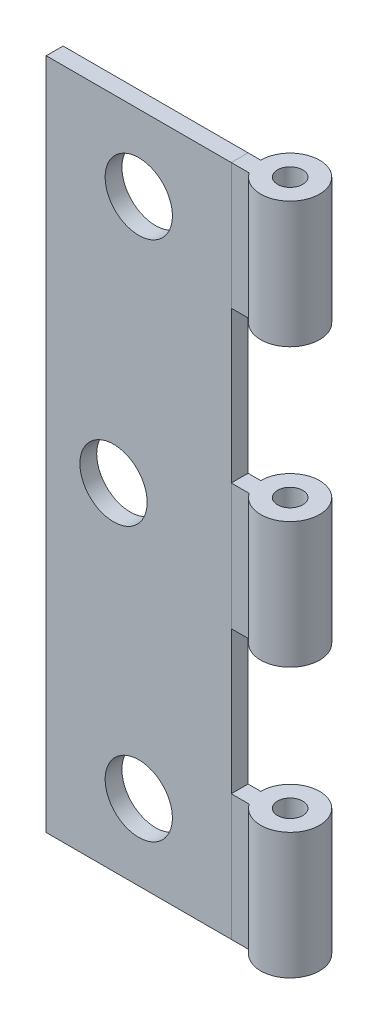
from build123d import *

# Parameters (mm, degrees)
SKETCH1_W               = 17.4625
SKETCH1_H               = 63.5
BOSS_EXTRUDE1_DEPTH     = 1.5875
SKETCH3_R               = 2.778125
SKETCH3_R_2             = 1.190625
SKETCH3_W               = 1.6888767
SKETCH3_H               = 1.5875
BOSS_EXTRUDE2_DEPTH     = 63.5
SKETCH4_R               = 3.175
CUT_EXTRUDE1_DEPTH      = 36.430958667
CUT_EXTRUDE3_DEPTH      = 36.430958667
CUT_EXTRUDE3_DEPTH_BACK = 36.430958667
SKETCH5_W               = 6.746875
SKETCH5_H               = 0.79375
SKETCH5_H_2             = 1.5875
SKETCH5_H_3             = 11.90625


with BuildPart() as part:
    # Sketch1 → Boss-Extrude1 (new body)
    with BuildSketch(Plane.XY):
        Rectangle(SKETCH1_W, SKETCH1_H)
    extrude(amount=-BOSS_EXTRUDE1_DEPTH)

    # Sketch4 → Cut-Extrude1 (cut, through all)
    with BuildSketch(Plane(origin=(0, 0, -1.5875), x_dir=(-1, 0, 0), z_dir=(0, 0, -1))):
        with Locations((0, 24.60625)):
            Circle(SKETCH4_R)
        with Locations((2.38125, 0)):
            Circle(SKETCH4_R)
        with Locations((0, -24.60625)):
            Circle(SKETCH4_R)
    extrude(amount=-CUT_EXTRUDE1_DEPTH, mode=Mode.SUBTRACT)


with BuildPart() as body_2:
    # Sketch3 → Boss-Extrude2 (new body)
    # profile 1 of 2: a face of its own
    with BuildSketch(Plane(origin=(0, 31.75, 0), x_dir=(1, 0, 0), z_dir=(0, 1, 0))):
        with Locations((12.7, 1.5875)):
            Circle(SKETCH3_R)
        with Locations(Location((12.7, 1.5875, 0), (0, 0, 270))):
            Circle(SKETCH3_R_2, mode=Mode.SUBTRACT)
    # profile 2 of 2: a face of its own
    with BuildSketch(Plane(origin=(0, 31.75, 0), x_dir=(1, 0, 0), z_dir=(0, 1, 0))):
        with Locations((9.57568835, 0.79375)):
            Rectangle(SKETCH3_W, SKETCH3_H)
    extrude(amount=-BOSS_EXTRUDE2_DEPTH)

    # Sketch5 → Cut-Extrude3 (cut, two sides: drawn at the far end of the back side and taken through both)
    with BuildSketch(Plane(origin=(0, 0, -1.5875), x_dir=(-1, 0, 0), z_dir=(0, 0, -1)).offset(-CUT_EXTRUDE3_DEPTH_BACK)):
        with Locations((-12.1046875, 19.446875)):
            Rectangle(SKETCH5_W, SKETCH5_H)
        with Locations((-12.1046875, 6.35)):
            Rectangle(SKETCH5_W, SKETCH5_H_2)
        with Locations((-12.1046875, -19.446875)):
            Rectangle(SKETCH5_W, SKETCH5_H)
        with Locations((-12.1046875, -6.746875)):
            Rectangle(SKETCH5_W, SKETCH5_H)
        with Locations((-12.1046875, 13.096875)):
            Rectangle(SKETCH5_W, SKETCH5_H_3)
        with Locations((-12.1046875, -13.096875)):
            Rectangle(SKETCH5_W, SKETCH5_H_3)
    extrude(amount=CUT_EXTRUDE3_DEPTH + CUT_EXTRUDE3_DEPTH_BACK, mode=Mode.SUBTRACT)


with BuildPart() as cut_extrude3_piece_1:
    # of the separate pieces the step leaves, piece 1, a body of its own (cut_extrude3_pieces)
    add(body_2.part.solids().sort_by_distance((9.921875, -6.35, -1.5875))[0])


with BuildPart() as cut_extrude3_piece_2:
    # of the separate pieces the step leaves, piece 2, a body of its own (cut_extrude3_pieces)
    add(body_2.part.solids().sort_by_distance((9.921875, -31.75, -1.5875))[0])


with BuildPart() as cut_extrude3_piece_3:
    # of the separate pieces the step leaves, piece 3, a body of its own (cut_extrude3_pieces)
    add(body_2.part.solids().sort_by_distance((9.921875, 19.84375, -1.5875))[0])


solid = Compound([part.part, cut_extrude3_piece_1.part, cut_extrude3_piece_2.part, cut_extrude3_piece_3.part])
